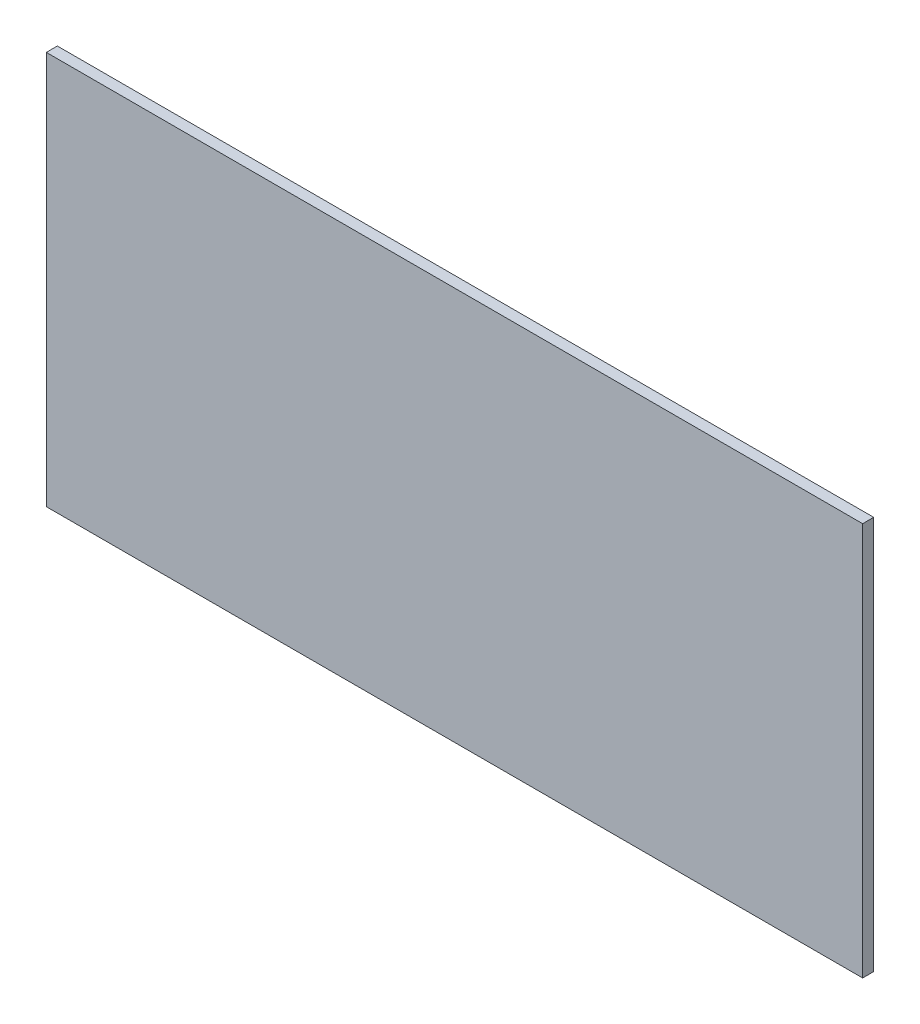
from build123d import *

# Parameters (mm, degrees)
ESQUISSE1_W      = 222
ESQUISSE1_H      = 107
EXTRUSION1_DEPTH = 3


with BuildPart() as part:
    # Esquisse1 → Extrusion1 (new body)
    with BuildSketch(Plane.XY):
        with Locations((111, 53.5)):
            Rectangle(ESQUISSE1_W, ESQUISSE1_H)
    extrude(amount=EXTRUSION1_DEPTH)


solid = part.part
